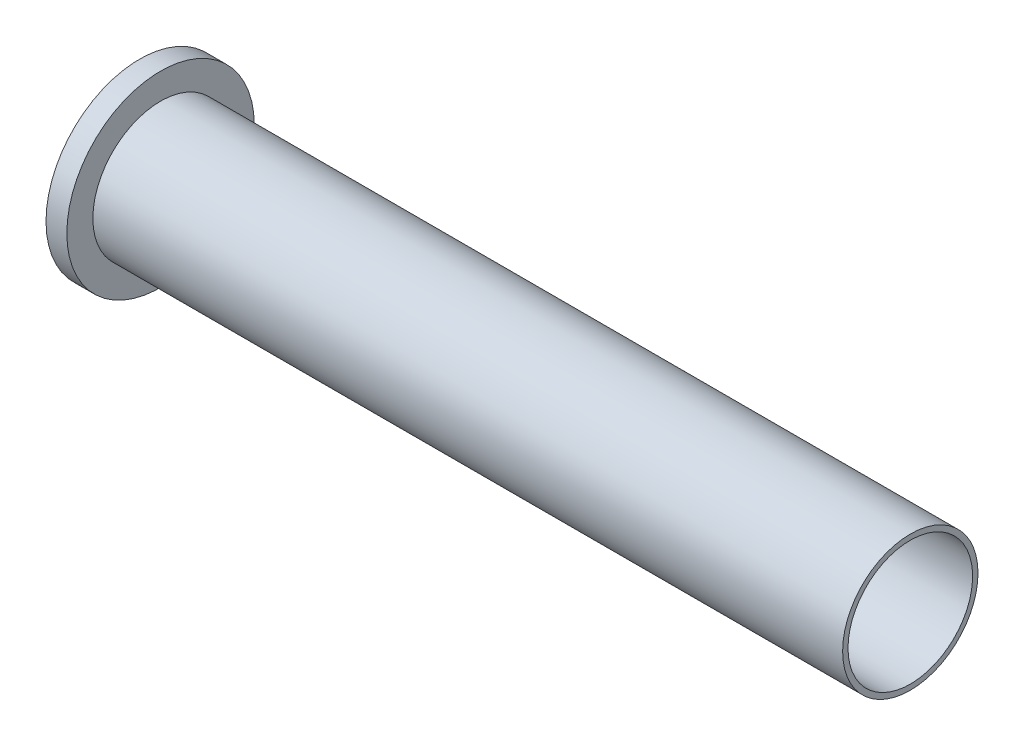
ISO-10303-21;
HEADER;
FILE_DESCRIPTION(('STEP AP214'),'2;1');
FILE_NAME('part.step','',(''),(''),'','','');
FILE_SCHEMA(('AUTOMOTIVE_DESIGN { 1 0 10303 214 1 1 1 1 }'));
ENDSEC;
DATA;
#1=APPLICATION_CONTEXT('core data for automotive mechanical design processes');
#2=APPLICATION_PROTOCOL_DEFINITION('international standard','automotive_design',2000,#1);
#3=PRODUCT_CONTEXT('',#1,'mechanical');
#4=PRODUCT('Part','Part','',(#3));
#5=PRODUCT_RELATED_PRODUCT_CATEGORY('part','',(#4));
#6=PRODUCT_DEFINITION_FORMATION('','',#4);
#7=PRODUCT_DEFINITION_CONTEXT('part definition',#1,'design');
#8=PRODUCT_DEFINITION('design','',#6,#7);
#9=PRODUCT_DEFINITION_SHAPE('','',#8);
#10=(LENGTH_UNIT() NAMED_UNIT(*) SI_UNIT(.MILLI.,.METRE.));
#11=(NAMED_UNIT(*) PLANE_ANGLE_UNIT() SI_UNIT($,.RADIAN.));
#12=(NAMED_UNIT(*) SI_UNIT($,.STERADIAN.) SOLID_ANGLE_UNIT());
#13=UNCERTAINTY_MEASURE_WITH_UNIT(LENGTH_MEASURE(1.E-05),#10,'distance_accuracy_value','');
#14=(GEOMETRIC_REPRESENTATION_CONTEXT(3) GLOBAL_UNCERTAINTY_ASSIGNED_CONTEXT((#13)) GLOBAL_UNIT_ASSIGNED_CONTEXT((#10,
#11,#12)) REPRESENTATION_CONTEXT('',''));
#15=CARTESIAN_POINT('',(0.,0.,0.));
#16=DIRECTION('',(0.,0.,1.));
#17=DIRECTION('',(1.,0.,0.));
#18=AXIS2_PLACEMENT_3D('',#15,#16,#17);
#19=CARTESIAN_POINT('',(228.6,0.,0.));
#20=DIRECTION('',(-1.,0.,0.));
#21=DIRECTION('',(0.,0.,1.));
#22=AXIS2_PLACEMENT_3D('',#19,#20,#21);
#23=CYLINDRICAL_SURFACE('',#22,20.6375);
#24=CARTESIAN_POINT('',(228.6,0.,0.));
#25=DIRECTION('',(1.,0.,0.));
#26=DIRECTION('',(0.,0.,-1.));
#27=AXIS2_PLACEMENT_3D('',#24,#25,#26);
#28=CIRCLE('',#27,20.6375);
#29=CARTESIAN_POINT('',(228.6,0.,-20.6375));
#30=VERTEX_POINT('',#29);
#31=EDGE_CURVE('E10',#30,#30,#28,.T.);
#32=ORIENTED_EDGE('',*,*,#31,.F.);
#33=EDGE_LOOP('',(#32));
#34=FACE_BOUND('',#33,.T.);
#35=CARTESIAN_POINT('',(0.,0.,0.));
#36=DIRECTION('',(-1.,0.,0.));
#37=DIRECTION('',(0.,0.,1.));
#38=AXIS2_PLACEMENT_3D('',#35,#36,#37);
#39=CIRCLE('',#38,20.6375);
#40=CARTESIAN_POINT('',(0.,0.,20.6375));
#41=VERTEX_POINT('',#40);
#42=EDGE_CURVE('E37',#41,#41,#39,.T.);
#43=ORIENTED_EDGE('',*,*,#42,.F.);
#44=EDGE_LOOP('',(#43));
#45=FACE_BOUND('',#44,.T.);
#46=ADVANCED_FACE('F31',(#34,#45),#23,.T.);
#47=CARTESIAN_POINT('',(228.6,0.,0.));
#48=DIRECTION('',(1.,0.,0.));
#49=DIRECTION('',(0.,0.,-1.));
#50=AXIS2_PLACEMENT_3D('',#47,#48,#49);
#51=PLANE('',#50);
#52=CARTESIAN_POINT('',(228.6,0.,0.));
#53=DIRECTION('',(-1.,0.,0.));
#54=DIRECTION('',(0.,0.,1.));
#55=AXIS2_PLACEMENT_3D('',#52,#53,#54);
#56=CIRCLE('',#55,18.9992);
#57=CARTESIAN_POINT('',(228.6,0.,18.9992));
#58=VERTEX_POINT('',#57);
#59=EDGE_CURVE('E50',#58,#58,#56,.T.);
#60=ORIENTED_EDGE('',*,*,#59,.T.);
#61=EDGE_LOOP('',(#60));
#62=FACE_BOUND('',#61,.T.);
#63=ORIENTED_EDGE('',*,*,#31,.T.);
#64=EDGE_LOOP('',(#63));
#65=FACE_BOUND('',#64,.T.);
#66=ADVANCED_FACE('F73',(#62,#65),#51,.T.);
#67=CARTESIAN_POINT('',(0.,0.,0.));
#68=DIRECTION('',(-1.,0.,0.));
#69=DIRECTION('',(0.,0.,1.));
#70=AXIS2_PLACEMENT_3D('',#67,#68,#69);
#71=PLANE('',#70);
#72=CARTESIAN_POINT('',(0.,0.,0.));
#73=DIRECTION('',(-1.,0.,0.));
#74=DIRECTION('',(0.,0.,1.));
#75=AXIS2_PLACEMENT_3D('',#72,#73,#74);
#76=CIRCLE('',#75,28.575);
#77=CARTESIAN_POINT('',(0.,0.,28.575));
#78=VERTEX_POINT('',#77);
#79=EDGE_CURVE('E45',#78,#78,#76,.T.);
#80=ORIENTED_EDGE('',*,*,#79,.F.);
#81=EDGE_LOOP('',(#80));
#82=FACE_BOUND('',#81,.T.);
#83=ORIENTED_EDGE('',*,*,#42,.T.);
#84=EDGE_LOOP('',(#83));
#85=FACE_BOUND('',#84,.T.);
#86=ADVANCED_FACE('F68',(#82,#85),#71,.F.);
#87=CARTESIAN_POINT('',(-6.35,0.,0.));
#88=DIRECTION('',(1.,0.,0.));
#89=DIRECTION('',(0.,0.,-1.));
#90=AXIS2_PLACEMENT_3D('',#87,#88,#89);
#91=CYLINDRICAL_SURFACE('',#90,28.575);
#92=CARTESIAN_POINT('',(-6.35,0.,0.));
#93=DIRECTION('',(-1.,0.,0.));
#94=DIRECTION('',(0.,0.,1.));
#95=AXIS2_PLACEMENT_3D('',#92,#93,#94);
#96=CIRCLE('',#95,28.575);
#97=CARTESIAN_POINT('',(-6.35,0.,28.575));
#98=VERTEX_POINT('',#97);
#99=EDGE_CURVE('E41',#98,#98,#96,.T.);
#100=ORIENTED_EDGE('',*,*,#99,.F.);
#101=EDGE_LOOP('',(#100));
#102=FACE_BOUND('',#101,.T.);
#103=ORIENTED_EDGE('',*,*,#79,.T.);
#104=EDGE_LOOP('',(#103));
#105=FACE_BOUND('',#104,.T.);
#106=ADVANCED_FACE('F62',(#102,#105),#91,.T.);
#107=CARTESIAN_POINT('',(-6.35,0.,0.));
#108=DIRECTION('',(-1.,0.,0.));
#109=DIRECTION('',(0.,0.,1.));
#110=AXIS2_PLACEMENT_3D('',#107,#108,#109);
#111=PLANE('',#110);
#112=CARTESIAN_POINT('',(-6.35,0.,0.));
#113=DIRECTION('',(-1.,0.,0.));
#114=DIRECTION('',(0.,0.,1.));
#115=AXIS2_PLACEMENT_3D('',#112,#113,#114);
#116=CIRCLE('',#115,18.9992);
#117=CARTESIAN_POINT('',(-6.35,0.,18.9992));
#118=VERTEX_POINT('',#117);
#119=EDGE_CURVE('E53',#118,#118,#116,.T.);
#120=ORIENTED_EDGE('',*,*,#119,.F.);
#121=EDGE_LOOP('',(#120));
#122=FACE_BOUND('',#121,.T.);
#123=ORIENTED_EDGE('',*,*,#99,.T.);
#124=EDGE_LOOP('',(#123));
#125=FACE_BOUND('',#124,.T.);
#126=ADVANCED_FACE('F59',(#122,#125),#111,.T.);
#127=CARTESIAN_POINT('',(228.6,0.,0.));
#128=DIRECTION('',(-1.,0.,0.));
#129=DIRECTION('',(0.,0.,1.));
#130=AXIS2_PLACEMENT_3D('',#127,#128,#129);
#131=CYLINDRICAL_SURFACE('',#130,18.9992);
#132=ORIENTED_EDGE('',*,*,#59,.F.);
#133=EDGE_LOOP('',(#132));
#134=FACE_BOUND('',#133,.T.);
#135=ORIENTED_EDGE('',*,*,#119,.T.);
#136=EDGE_LOOP('',(#135));
#137=FACE_BOUND('',#136,.T.);
#138=ADVANCED_FACE('F57',(#134,#137),#131,.F.);
#139=CLOSED_SHELL('',(#46,#66,#86,#106,#126,#138));
#140=MANIFOLD_SOLID_BREP('B2',#139);
#141=ADVANCED_BREP_SHAPE_REPRESENTATION('',(#18,#140),#14);
#142=SHAPE_DEFINITION_REPRESENTATION(#9,#141);
ENDSEC;
END-ISO-10303-21;
